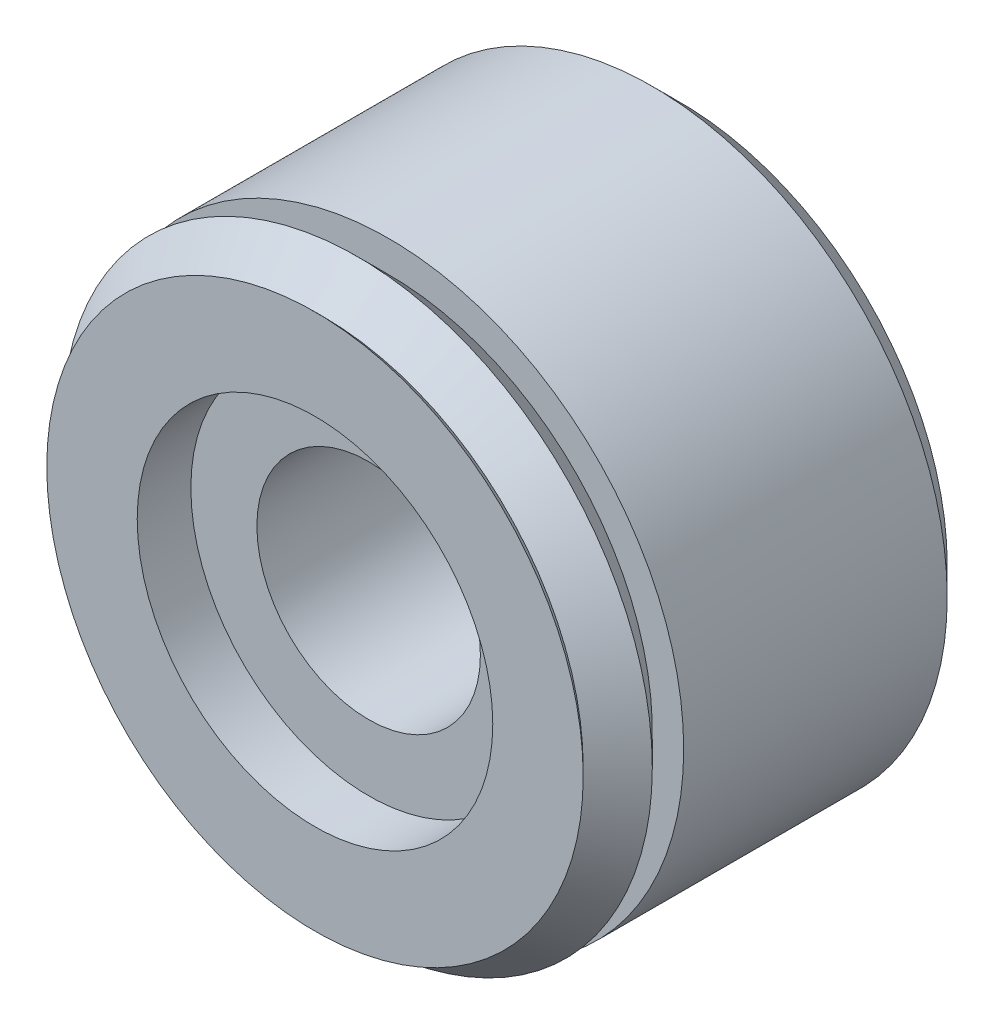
from build123d import *

# Parameters (mm, degrees)
BACK_CHAMFER_SIZE  = 0.79375
SKETCH3_R          = 3.175
HOLE_CUT_DEPTH     = 16.752070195
SKETCH14_R         = 5.050924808
CUT_EXTRUDE1_DEPTH = 1.524


with BuildPart() as part:
    # Sketch1 → Base (revolve)
    with BuildSketch(Plane(origin=(0, 0, 0), x_dir=(0, 0, -1), z_dir=(1, 0, 0)), mode=Mode.PRIVATE) as base_sk:
        Polygon((0, 0), (0, 7.62), (0.21971, 7.40029), (1.20142, 8.382), (2.093214, 7.490206), (2.093214, 8.382), (10.373614, 8.382), (10.373614, 0), align=None)
    revolve(base_sk.sketch.rotate(Axis((0, 0, -71.294124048), (0, 0, 1)), 90), axis=Axis((0, 0, -71.294124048), (0, 0, 1)))

    # Back Chamfer
    back_chamfer_edges = [part.edges().sort_by_distance(p)[0] for p in [
        (8.382, 0, -10.373614),
    ]]
    chamfer(back_chamfer_edges, length=BACK_CHAMFER_SIZE)

    # Sketch3 → Hole Cut (cut, through all)
    with BuildSketch(Plane(origin=(0, 0, 0), x_dir=(-1, 0, 0), z_dir=(0, 0, -1))):
        Circle(SKETCH3_R)
    extrude(amount=HOLE_CUT_DEPTH, mode=Mode.SUBTRACT)

    # Sketch14 → Cut-Extrude1 (cut)
    with BuildSketch(Plane.XY):
        Circle(SKETCH14_R)
    extrude(amount=-CUT_EXTRUDE1_DEPTH, mode=Mode.SUBTRACT)


solid = part.part
